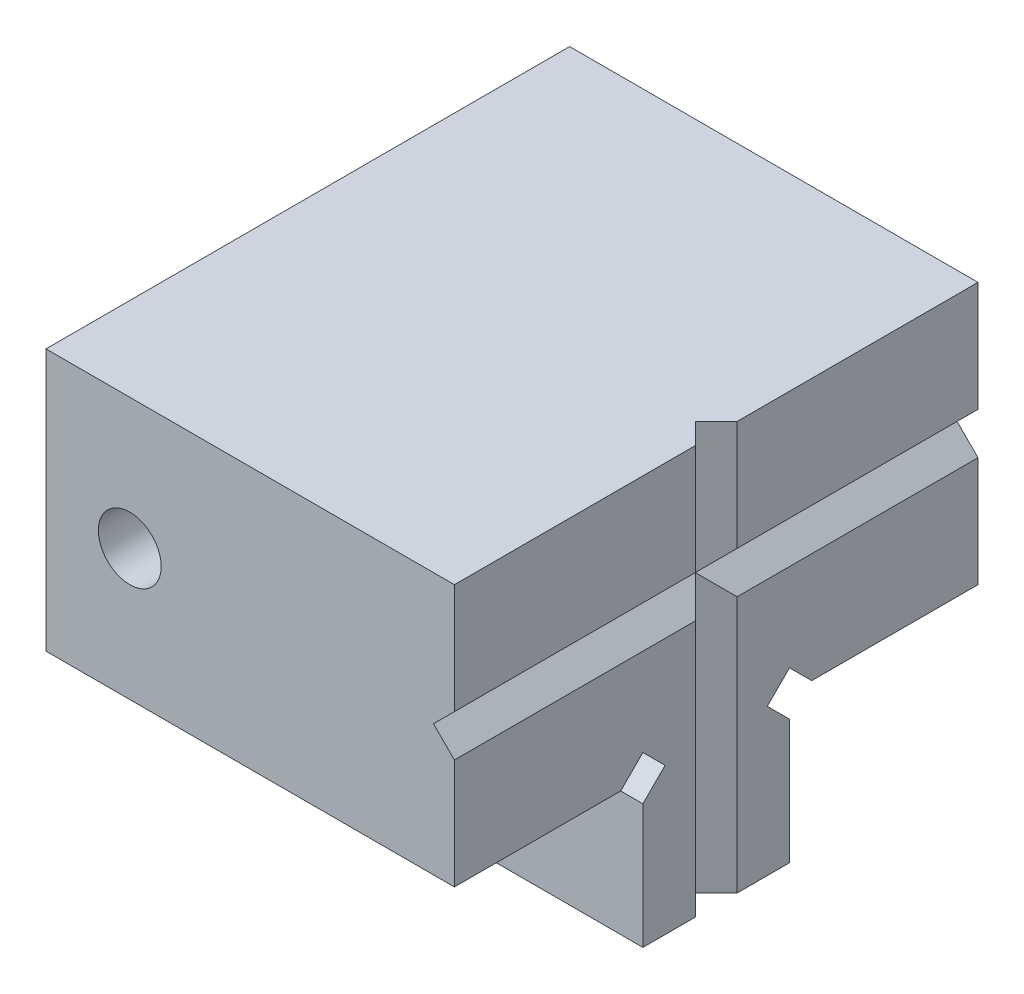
from build123d import *

# Parameters (mm, degrees)
EXTRUDE_1_DEPTH     = 39
CUT_EXTRUDE_1_DEPTH = 75.444610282
CUT_EXTRUDE_2_DEPTH = 61.555759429
SKETCH_4_R          = 3
CUT_EXTRUDE_3_DEPTH = 75.444610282
SKETCH_5_R          = 11
CUT_EXTRUDE_4_DEPTH = 3.5
SKETCH_6_R          = 6
CUT_EXTRUDE_5_DEPTH = 13


with BuildPart() as part:
    # Sketch 1 → Extrude 1 (new body)
    with BuildSketch(Plane(origin=(0, 0, 0), x_dir=(0, 0, -1), z_dir=(1, 0, 0))):
        Polygon((-7, 0), (-7, 11.878679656), (-4.878679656, 14), (-7, 16.121320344), (-9.121320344, 14), (-25, 14), (-25, 39), (25, 39), (25, 14), (9.121320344, 14), (7, 16.121320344), (4.878679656, 14), (7, 11.878679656), (7, 0), align=None)
    extrude(amount=-EXTRUDE_1_DEPTH)

    # Sketch 2 → Cut-Extrude 1 (cut, through all)
    with BuildSketch(Plane.XY.offset(25)):
        Polygon((0, 24.5), (0, 28.5), (-2, 26.5), align=None)
    extrude(amount=-CUT_EXTRUDE_1_DEPTH, mode=Mode.SUBTRACT)

    # Sketch 3 → Cut-Extrude 2 (cut, through all)
    with BuildSketch(Plane(origin=(0, 39, 0), x_dir=(1, 0, 0), z_dir=(0, 1, 0))):
        Polygon((0, 2), (0, -2), (-2, 0), align=None)
    extrude(amount=-CUT_EXTRUDE_2_DEPTH, mode=Mode.SUBTRACT)

    # Sketch 4 → Cut-Extrude 3 (cut, through all)
    with BuildSketch(Plane(origin=(0, 0, -25), x_dir=(-1, 0, 0), z_dir=(0, 0, -1))):
        with Locations(Location((31, 26.5, 0), (0, 0, 90))):
            Circle(SKETCH_4_R)
    extrude(amount=-CUT_EXTRUDE_3_DEPTH, mode=Mode.SUBTRACT)

    # Sketch 5 → Cut-Extrude 4 (cut)
    with BuildSketch(Plane.ZY.offset(39)):
        with Locations((0, 26.5)):
            Circle(SKETCH_5_R)
    extrude(amount=-CUT_EXTRUDE_4_DEPTH, mode=Mode.SUBTRACT)

    # Sketch 6 → Cut-Extrude 5 (cut)
    with BuildSketch(Plane.ZY.offset(35.5)):
        with Locations((0, 26.5)):
            Circle(SKETCH_6_R)
    extrude(amount=-CUT_EXTRUDE_5_DEPTH, mode=Mode.SUBTRACT)


solid = part.part
